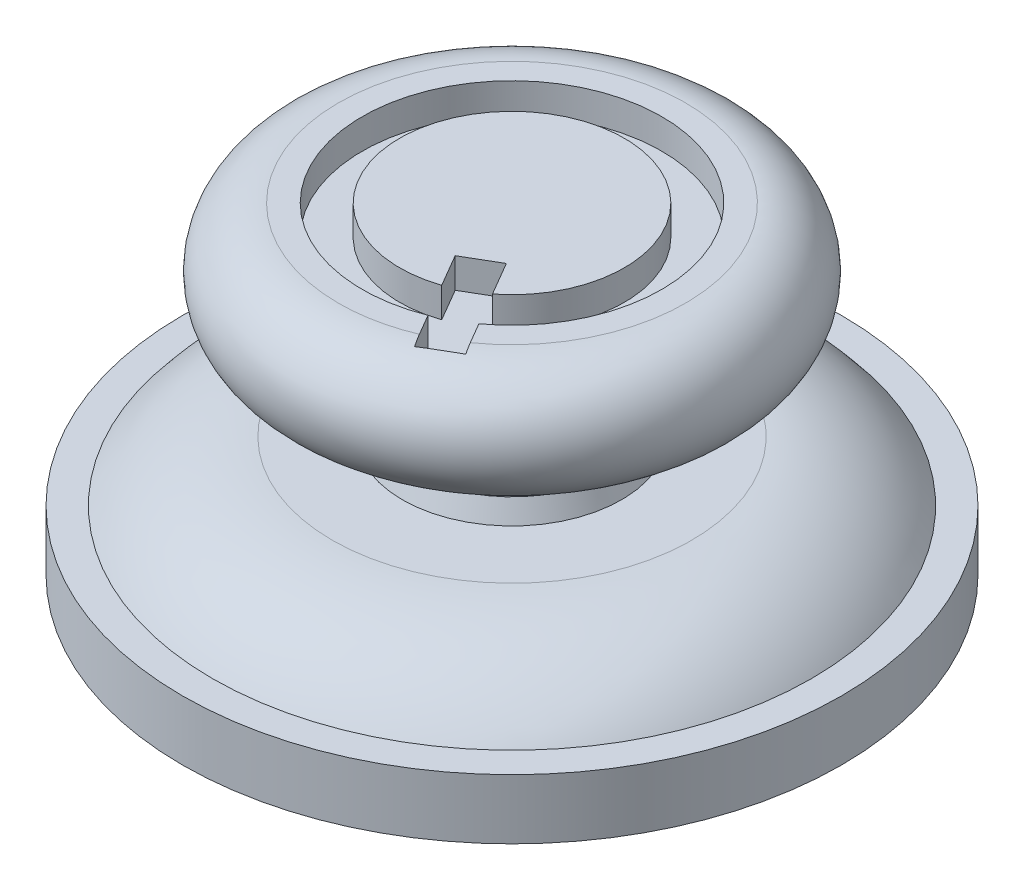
from build123d import *

# Parameters (mm, degrees)
CUT_EXTRUDE1_DEPTH = 1


with BuildPart() as part:
    # Sketch1 → Revolve2 (revolve)
    with BuildSketch(Plane.XY, mode=Mode.PRIVATE) as revolve2_sk:
        with BuildLine():
            Line((-3.66047113, -0.999644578), (-6, -0.999644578))
            ThreePointArc((-6, -0.999644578), (-8.236067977, -1.527508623), (-10, -2.999644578))
            Line((-10, -2.999644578), (-11, -2.999644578))
            Line((-11, -2.999644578), (-11, -4.999644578))
            Line((-11, -4.999644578), (-10, -4.999644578))
            Line((-10, -4.999644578), (-10, -3.499644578))
            Line((-10, -3.499644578), (0, -3.499644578))
            Line((0, -3.499644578), (0, 0))
            Line((0, 0), (0, 5.75))
            Line((0, 5.75), (-5.794000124, 5.75))
            ThreePointArc((-5.794000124, 5.75), (-7.756023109, 3.787977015), (-5.794000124, 1.82595403))
            ThreePointArc((-5.794000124, 1.82595403), (-4.189373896, 1.20671998), (-3.416712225, -0.329922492))
            Line((-3.416712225, -0.329922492), (-3.66047113, -0.999644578))
        make_face()
    revolve(revolve2_sk.sketch.rotate(Axis((0, 8.274041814, 0), (0, -1, 0)), 270), axis=Axis((0, 8.274041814, 0), (0, -1, 0)))

    # Sketch2 → Cut-Extrude1 (cut)
    with BuildSketch(Plane(origin=(0, 5.75, 0), x_dir=(1, 0, 0), z_dir=(0, 1, 0))):
        with BuildLine():
            Line((2.474247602, -5.727056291), (3.553818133, -5.096955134))
            Line((3.553818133, -5.096955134), (2.939599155, -4.044596))
            ThreePointArc((2.939599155, -4.044596), (-2.410793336, 4.380419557), (1.844146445, -4.64748576))
            Line((1.844146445, -4.64748576), (2.474247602, -5.727056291))
        make_face()
        with BuildLine():
            Line((0.57426811, -2.471766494), (1.204369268, -3.551337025))
            ThreePointArc((1.204369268, -3.551337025), (-1.77973273, 3.300765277), (2.305253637, -2.957753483))
            Line((2.305253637, -2.957753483), (1.653838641, -1.841665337))
            Line((1.653838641, -1.841665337), (0.57426811, -2.471766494))
        make_face(mode=Mode.SUBTRACT)
    extrude(amount=-CUT_EXTRUDE1_DEPTH, mode=Mode.SUBTRACT)


solid = part.part
